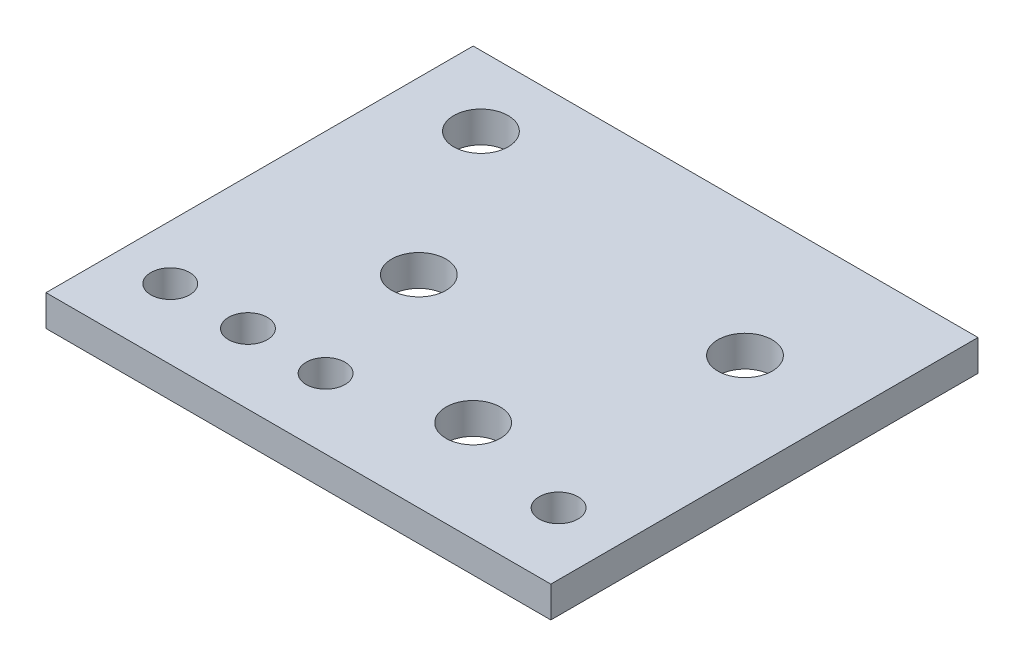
ISO-10303-21;
HEADER;
FILE_DESCRIPTION(('STEP AP214'),'2;1');
FILE_NAME('part.step','',(''),(''),'','','');
FILE_SCHEMA(('AUTOMOTIVE_DESIGN { 1 0 10303 214 1 1 1 1 }'));
ENDSEC;
DATA;
#1=APPLICATION_CONTEXT('core data for automotive mechanical design processes');
#2=APPLICATION_PROTOCOL_DEFINITION('international standard','automotive_design',2000,#1);
#3=PRODUCT_CONTEXT('',#1,'mechanical');
#4=PRODUCT('Part','Part','',(#3));
#5=PRODUCT_RELATED_PRODUCT_CATEGORY('part','',(#4));
#6=PRODUCT_DEFINITION_FORMATION('','',#4);
#7=PRODUCT_DEFINITION_CONTEXT('part definition',#1,'design');
#8=PRODUCT_DEFINITION('design','',#6,#7);
#9=PRODUCT_DEFINITION_SHAPE('','',#8);
#10=(LENGTH_UNIT() NAMED_UNIT(*) SI_UNIT(.MILLI.,.METRE.));
#11=(NAMED_UNIT(*) PLANE_ANGLE_UNIT() SI_UNIT($,.RADIAN.));
#12=(NAMED_UNIT(*) SI_UNIT($,.STERADIAN.) SOLID_ANGLE_UNIT());
#13=UNCERTAINTY_MEASURE_WITH_UNIT(LENGTH_MEASURE(1.E-05),#10,'distance_accuracy_value','');
#14=(GEOMETRIC_REPRESENTATION_CONTEXT(3) GLOBAL_UNCERTAINTY_ASSIGNED_CONTEXT((#13)) GLOBAL_UNIT_ASSIGNED_CONTEXT((#10,
#11,#12)) REPRESENTATION_CONTEXT('',''));
#15=CARTESIAN_POINT('',(0.,0.,0.));
#16=DIRECTION('',(0.,0.,1.));
#17=DIRECTION('',(1.,0.,0.));
#18=AXIS2_PLACEMENT_3D('',#15,#16,#17);
#19=CARTESIAN_POINT('',(0.,20.,0.));
#20=DIRECTION('',(1.,0.,0.));
#21=DIRECTION('',(0.,0.,-1.));
#22=AXIS2_PLACEMENT_3D('',#19,#20,#21);
#23=PLANE('',#22);
#24=DIRECTION('',(0.,0.,1.));
#25=VECTOR('',#24,1.);
#26=CARTESIAN_POINT('',(0.,0.,0.));
#27=LINE('',#26,#25);
#28=CARTESIAN_POINT('',(0.,0.,-275.));
#29=VERTEX_POINT('',#28);
#30=CARTESIAN_POINT('',(0.,0.,0.));
#31=VERTEX_POINT('',#30);
#32=EDGE_CURVE('E72',#29,#31,#27,.T.);
#33=ORIENTED_EDGE('',*,*,#32,.T.);
#34=DIRECTION('',(0.,-1.,0.));
#35=VECTOR('',#34,1.);
#36=CARTESIAN_POINT('',(0.,20.,0.));
#37=LINE('',#36,#35);
#38=CARTESIAN_POINT('',(0.,20.,0.));
#39=VERTEX_POINT('',#38);
#40=EDGE_CURVE('E11',#39,#31,#37,.T.);
#41=ORIENTED_EDGE('',*,*,#40,.F.);
#42=DIRECTION('',(0.,0.,1.));
#43=VECTOR('',#42,1.);
#44=CARTESIAN_POINT('',(0.,20.,0.));
#45=LINE('',#44,#43);
#46=CARTESIAN_POINT('',(0.,20.,-275.));
#47=VERTEX_POINT('',#46);
#48=EDGE_CURVE('E95',#47,#39,#45,.T.);
#49=ORIENTED_EDGE('',*,*,#48,.F.);
#50=DIRECTION('',(0.,-1.,0.));
#51=VECTOR('',#50,1.);
#52=CARTESIAN_POINT('',(0.,20.,-275.));
#53=LINE('',#52,#51);
#54=EDGE_CURVE('E84',#47,#29,#53,.T.);
#55=ORIENTED_EDGE('',*,*,#54,.T.);
#56=EDGE_LOOP('',(#33,#41,#49,#55));
#57=FACE_BOUND('',#56,.T.);
#58=ADVANCED_FACE('F28',(#57),#23,.F.);
#59=CARTESIAN_POINT('',(0.,20.,0.));
#60=DIRECTION('',(0.,0.,-1.));
#61=DIRECTION('',(-1.,0.,0.));
#62=AXIS2_PLACEMENT_3D('',#59,#60,#61);
#63=PLANE('',#62);
#64=DIRECTION('',(1.,0.,0.));
#65=VECTOR('',#64,1.);
#66=CARTESIAN_POINT('',(0.,0.,0.));
#67=LINE('',#66,#65);
#68=CARTESIAN_POINT('',(325.,0.,0.));
#69=VERTEX_POINT('',#68);
#70=EDGE_CURVE('E68',#31,#69,#67,.T.);
#71=ORIENTED_EDGE('',*,*,#70,.T.);
#72=DIRECTION('',(0.,-1.,0.));
#73=VECTOR('',#72,1.);
#74=CARTESIAN_POINT('',(325.,20.,0.));
#75=LINE('',#74,#73);
#76=CARTESIAN_POINT('',(325.,20.,0.));
#77=VERTEX_POINT('',#76);
#78=EDGE_CURVE('E35',#77,#69,#75,.T.);
#79=ORIENTED_EDGE('',*,*,#78,.F.);
#80=DIRECTION('',(1.,0.,0.));
#81=VECTOR('',#80,1.);
#82=CARTESIAN_POINT('',(0.,20.,0.));
#83=LINE('',#82,#81);
#84=EDGE_CURVE('E80',#39,#77,#83,.T.);
#85=ORIENTED_EDGE('',*,*,#84,.F.);
#86=ORIENTED_EDGE('',*,*,#40,.T.);
#87=EDGE_LOOP('',(#71,#79,#85,#86));
#88=FACE_BOUND('',#87,.T.);
#89=ADVANCED_FACE('F79',(#88),#63,.F.);
#90=CARTESIAN_POINT('',(325.,20.,0.));
#91=DIRECTION('',(-1.,0.,0.));
#92=DIRECTION('',(0.,0.,1.));
#93=AXIS2_PLACEMENT_3D('',#90,#91,#92);
#94=PLANE('',#93);
#95=DIRECTION('',(0.,0.,-1.));
#96=VECTOR('',#95,1.);
#97=CARTESIAN_POINT('',(325.,0.,0.));
#98=LINE('',#97,#96);
#99=CARTESIAN_POINT('',(325.,0.,-275.));
#100=VERTEX_POINT('',#99);
#101=EDGE_CURVE('E73',#69,#100,#98,.T.);
#102=ORIENTED_EDGE('',*,*,#101,.T.);
#103=DIRECTION('',(0.,-1.,0.));
#104=VECTOR('',#103,1.);
#105=CARTESIAN_POINT('',(325.,20.,-275.));
#106=LINE('',#105,#104);
#107=CARTESIAN_POINT('',(325.,20.,-275.));
#108=VERTEX_POINT('',#107);
#109=EDGE_CURVE('E101',#108,#100,#106,.T.);
#110=ORIENTED_EDGE('',*,*,#109,.F.);
#111=DIRECTION('',(0.,0.,-1.));
#112=VECTOR('',#111,1.);
#113=CARTESIAN_POINT('',(325.,20.,0.));
#114=LINE('',#113,#112);
#115=EDGE_CURVE('E47',#77,#108,#114,.T.);
#116=ORIENTED_EDGE('',*,*,#115,.F.);
#117=ORIENTED_EDGE('',*,*,#78,.T.);
#118=EDGE_LOOP('',(#102,#110,#116,#117));
#119=FACE_BOUND('',#118,.T.);
#120=ADVANCED_FACE('F104',(#119),#94,.F.);
#121=CARTESIAN_POINT('',(0.,20.,-275.));
#122=DIRECTION('',(0.,0.,1.));
#123=DIRECTION('',(1.,0.,0.));
#124=AXIS2_PLACEMENT_3D('',#121,#122,#123);
#125=PLANE('',#124);
#126=DIRECTION('',(-1.,0.,0.));
#127=VECTOR('',#126,1.);
#128=CARTESIAN_POINT('',(0.,0.,-275.));
#129=LINE('',#128,#127);
#130=EDGE_CURVE('E93',#100,#29,#129,.T.);
#131=ORIENTED_EDGE('',*,*,#130,.T.);
#132=ORIENTED_EDGE('',*,*,#54,.F.);
#133=DIRECTION('',(-1.,0.,0.));
#134=VECTOR('',#133,1.);
#135=CARTESIAN_POINT('',(0.,20.,-275.));
#136=LINE('',#135,#134);
#137=EDGE_CURVE('E42',#108,#47,#136,.T.);
#138=ORIENTED_EDGE('',*,*,#137,.F.);
#139=ORIENTED_EDGE('',*,*,#109,.T.);
#140=EDGE_LOOP('',(#131,#132,#138,#139));
#141=FACE_BOUND('',#140,.T.);
#142=ADVANCED_FACE('F106',(#141),#125,.F.);
#143=CARTESIAN_POINT('',(0.,20.,-275.));
#144=DIRECTION('',(0.,-1.,0.));
#145=DIRECTION('',(0.,0.,-1.));
#146=AXIS2_PLACEMENT_3D('',#143,#144,#145);
#147=PLANE('',#146);
#148=CARTESIAN_POINT('',(260.,19.9999999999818,-190.));
#149=DIRECTION('',(0.,1.,0.));
#150=DIRECTION('',(0.,0.,1.));
#151=AXIS2_PLACEMENT_3D('',#148,#149,#150);
#152=CIRCLE('',#151,17.5);
#153=CARTESIAN_POINT('',(260.,19.9999999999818,-172.5));
#154=VERTEX_POINT('',#153);
#155=EDGE_CURVE('E206',#154,#154,#152,.T.);
#156=ORIENTED_EDGE('',*,*,#155,.F.);
#157=EDGE_LOOP('',(#156));
#158=FACE_BOUND('',#157,.T.);
#159=CARTESIAN_POINT('',(110.,19.9999999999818,-130.));
#160=DIRECTION('',(0.,1.,0.));
#161=DIRECTION('',(0.,0.,1.));
#162=AXIS2_PLACEMENT_3D('',#159,#160,#161);
#163=CIRCLE('',#162,17.5);
#164=CARTESIAN_POINT('',(110.,19.9999999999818,-112.5));
#165=VERTEX_POINT('',#164);
#166=EDGE_CURVE('E208',#165,#165,#163,.T.);
#167=ORIENTED_EDGE('',*,*,#166,.F.);
#168=EDGE_LOOP('',(#167));
#169=FACE_BOUND('',#168,.T.);
#170=CARTESIAN_POINT('',(50.,19.9999999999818,-230.));
#171=DIRECTION('',(0.,1.,0.));
#172=DIRECTION('',(0.,0.,1.));
#173=AXIS2_PLACEMENT_3D('',#170,#171,#172);
#174=CIRCLE('',#173,17.5);
#175=CARTESIAN_POINT('',(50.,19.9999999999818,-212.5));
#176=VERTEX_POINT('',#175);
#177=EDGE_CURVE('E216',#176,#176,#174,.T.);
#178=ORIENTED_EDGE('',*,*,#177,.F.);
#179=EDGE_LOOP('',(#178));
#180=FACE_BOUND('',#179,.T.);
#181=CARTESIAN_POINT('',(285.,20.,-45.));
#182=DIRECTION('',(0.,1.,0.));
#183=DIRECTION('',(0.,0.,1.));
#184=AXIS2_PLACEMENT_3D('',#181,#182,#183);
#185=CIRCLE('',#184,12.5);
#186=CARTESIAN_POINT('',(285.,20.,-32.5));
#187=VERTEX_POINT('',#186);
#188=EDGE_CURVE('E222',#187,#187,#185,.T.);
#189=ORIENTED_EDGE('',*,*,#188,.F.);
#190=EDGE_LOOP('',(#189));
#191=FACE_BOUND('',#190,.T.);
#192=CARTESIAN_POINT('',(135.,20.,-45.));
#193=DIRECTION('',(0.,1.,0.));
#194=DIRECTION('',(0.,0.,1.));
#195=AXIS2_PLACEMENT_3D('',#192,#193,#194);
#196=CIRCLE('',#195,12.5);
#197=CARTESIAN_POINT('',(135.,20.,-32.5));
#198=VERTEX_POINT('',#197);
#199=EDGE_CURVE('E228',#198,#198,#196,.T.);
#200=ORIENTED_EDGE('',*,*,#199,.F.);
#201=EDGE_LOOP('',(#200));
#202=FACE_BOUND('',#201,.T.);
#203=CARTESIAN_POINT('',(85.,20.,-45.));
#204=DIRECTION('',(0.,1.,0.));
#205=DIRECTION('',(0.,0.,1.));
#206=AXIS2_PLACEMENT_3D('',#203,#204,#205);
#207=CIRCLE('',#206,12.5);
#208=CARTESIAN_POINT('',(85.,20.,-32.5));
#209=VERTEX_POINT('',#208);
#210=EDGE_CURVE('E234',#209,#209,#207,.T.);
#211=ORIENTED_EDGE('',*,*,#210,.F.);
#212=EDGE_LOOP('',(#211));
#213=FACE_BOUND('',#212,.T.);
#214=CARTESIAN_POINT('',(210.,19.9999999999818,-65.));
#215=DIRECTION('',(0.,1.,0.));
#216=DIRECTION('',(0.,0.,1.));
#217=AXIS2_PLACEMENT_3D('',#214,#215,#216);
#218=CIRCLE('',#217,17.5);
#219=CARTESIAN_POINT('',(210.,19.9999999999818,-47.5));
#220=VERTEX_POINT('',#219);
#221=EDGE_CURVE('E240',#220,#220,#218,.T.);
#222=ORIENTED_EDGE('',*,*,#221,.F.);
#223=EDGE_LOOP('',(#222));
#224=FACE_BOUND('',#223,.T.);
#225=CARTESIAN_POINT('',(35.,20.,-45.));
#226=DIRECTION('',(0.,1.,0.));
#227=DIRECTION('',(0.,0.,1.));
#228=AXIS2_PLACEMENT_3D('',#225,#226,#227);
#229=CIRCLE('',#228,12.5);
#230=CARTESIAN_POINT('',(35.,20.,-32.5));
#231=VERTEX_POINT('',#230);
#232=EDGE_CURVE('E88',#231,#231,#229,.T.);
#233=ORIENTED_EDGE('',*,*,#232,.F.);
#234=EDGE_LOOP('',(#233));
#235=FACE_BOUND('',#234,.T.);
#236=ORIENTED_EDGE('',*,*,#48,.T.);
#237=ORIENTED_EDGE('',*,*,#84,.T.);
#238=ORIENTED_EDGE('',*,*,#115,.T.);
#239=ORIENTED_EDGE('',*,*,#137,.T.);
#240=EDGE_LOOP('',(#236,#237,#238,#239));
#241=FACE_BOUND('',#240,.T.);
#242=ADVANCED_FACE('F107',(#158,#169,#180,#191,#202,#213,#224,#235,#241),#147,.F.);
#243=CARTESIAN_POINT('',(0.,0.,-275.));
#244=DIRECTION('',(0.,-1.,0.));
#245=DIRECTION('',(0.,0.,-1.));
#246=AXIS2_PLACEMENT_3D('',#243,#244,#245);
#247=PLANE('',#246);
#248=CARTESIAN_POINT('',(260.,0.,-190.));
#249=DIRECTION('',(0.,1.,0.));
#250=DIRECTION('',(0.,0.,1.));
#251=AXIS2_PLACEMENT_3D('',#248,#249,#250);
#252=CIRCLE('',#251,17.5);
#253=CARTESIAN_POINT('',(260.,0.,-172.5));
#254=VERTEX_POINT('',#253);
#255=EDGE_CURVE('E204',#254,#254,#252,.T.);
#256=ORIENTED_EDGE('',*,*,#255,.T.);
#257=EDGE_LOOP('',(#256));
#258=FACE_BOUND('',#257,.T.);
#259=CARTESIAN_POINT('',(110.,0.,-130.));
#260=DIRECTION('',(0.,1.,0.));
#261=DIRECTION('',(0.,0.,1.));
#262=AXIS2_PLACEMENT_3D('',#259,#260,#261);
#263=CIRCLE('',#262,17.5);
#264=CARTESIAN_POINT('',(110.,0.,-112.5));
#265=VERTEX_POINT('',#264);
#266=EDGE_CURVE('E213',#265,#265,#263,.T.);
#267=ORIENTED_EDGE('',*,*,#266,.T.);
#268=EDGE_LOOP('',(#267));
#269=FACE_BOUND('',#268,.T.);
#270=CARTESIAN_POINT('',(50.,0.,-230.));
#271=DIRECTION('',(0.,1.,0.));
#272=DIRECTION('',(0.,0.,1.));
#273=AXIS2_PLACEMENT_3D('',#270,#271,#272);
#274=CIRCLE('',#273,17.5);
#275=CARTESIAN_POINT('',(50.,0.,-212.5));
#276=VERTEX_POINT('',#275);
#277=EDGE_CURVE('E219',#276,#276,#274,.T.);
#278=ORIENTED_EDGE('',*,*,#277,.T.);
#279=EDGE_LOOP('',(#278));
#280=FACE_BOUND('',#279,.T.);
#281=CARTESIAN_POINT('',(285.,0.,-45.));
#282=DIRECTION('',(0.,1.,0.));
#283=DIRECTION('',(0.,0.,1.));
#284=AXIS2_PLACEMENT_3D('',#281,#282,#283);
#285=CIRCLE('',#284,12.5);
#286=CARTESIAN_POINT('',(285.,0.,-32.5));
#287=VERTEX_POINT('',#286);
#288=EDGE_CURVE('E225',#287,#287,#285,.T.);
#289=ORIENTED_EDGE('',*,*,#288,.T.);
#290=EDGE_LOOP('',(#289));
#291=FACE_BOUND('',#290,.T.);
#292=CARTESIAN_POINT('',(135.,0.,-45.));
#293=DIRECTION('',(0.,1.,0.));
#294=DIRECTION('',(0.,0.,1.));
#295=AXIS2_PLACEMENT_3D('',#292,#293,#294);
#296=CIRCLE('',#295,12.5);
#297=CARTESIAN_POINT('',(135.,0.,-32.5));
#298=VERTEX_POINT('',#297);
#299=EDGE_CURVE('E231',#298,#298,#296,.T.);
#300=ORIENTED_EDGE('',*,*,#299,.T.);
#301=EDGE_LOOP('',(#300));
#302=FACE_BOUND('',#301,.T.);
#303=CARTESIAN_POINT('',(85.,0.,-45.));
#304=DIRECTION('',(0.,1.,0.));
#305=DIRECTION('',(0.,0.,1.));
#306=AXIS2_PLACEMENT_3D('',#303,#304,#305);
#307=CIRCLE('',#306,12.5);
#308=CARTESIAN_POINT('',(85.,0.,-32.5));
#309=VERTEX_POINT('',#308);
#310=EDGE_CURVE('E237',#309,#309,#307,.T.);
#311=ORIENTED_EDGE('',*,*,#310,.T.);
#312=EDGE_LOOP('',(#311));
#313=FACE_BOUND('',#312,.T.);
#314=CARTESIAN_POINT('',(210.,0.,-65.));
#315=DIRECTION('',(0.,1.,0.));
#316=DIRECTION('',(0.,0.,1.));
#317=AXIS2_PLACEMENT_3D('',#314,#315,#316);
#318=CIRCLE('',#317,17.5);
#319=CARTESIAN_POINT('',(210.,0.,-47.5));
#320=VERTEX_POINT('',#319);
#321=EDGE_CURVE('E243',#320,#320,#318,.T.);
#322=ORIENTED_EDGE('',*,*,#321,.T.);
#323=EDGE_LOOP('',(#322));
#324=FACE_BOUND('',#323,.T.);
#325=CARTESIAN_POINT('',(35.,0.,-45.));
#326=DIRECTION('',(0.,1.,0.));
#327=DIRECTION('',(0.,0.,1.));
#328=AXIS2_PLACEMENT_3D('',#325,#326,#327);
#329=CIRCLE('',#328,12.5);
#330=CARTESIAN_POINT('',(35.,0.,-32.5));
#331=VERTEX_POINT('',#330);
#332=EDGE_CURVE('E85',#331,#331,#329,.T.);
#333=ORIENTED_EDGE('',*,*,#332,.T.);
#334=EDGE_LOOP('',(#333));
#335=FACE_BOUND('',#334,.T.);
#336=ORIENTED_EDGE('',*,*,#32,.F.);
#337=ORIENTED_EDGE('',*,*,#130,.F.);
#338=ORIENTED_EDGE('',*,*,#101,.F.);
#339=ORIENTED_EDGE('',*,*,#70,.F.);
#340=EDGE_LOOP('',(#336,#337,#338,#339));
#341=FACE_BOUND('',#340,.T.);
#342=ADVANCED_FACE('F69',(#258,#269,#280,#291,#302,#313,#324,#335,#341),#247,.T.);
#343=CARTESIAN_POINT('',(35.,0.,-45.));
#344=DIRECTION('',(0.,1.,0.));
#345=DIRECTION('',(0.,0.,1.));
#346=AXIS2_PLACEMENT_3D('',#343,#344,#345);
#347=CYLINDRICAL_SURFACE('',#346,12.5);
#348=ORIENTED_EDGE('',*,*,#332,.F.);
#349=EDGE_LOOP('',(#348));
#350=FACE_BOUND('',#349,.T.);
#351=ORIENTED_EDGE('',*,*,#232,.T.);
#352=EDGE_LOOP('',(#351));
#353=FACE_BOUND('',#352,.T.);
#354=ADVANCED_FACE('F115',(#350,#353),#347,.F.);
#355=CARTESIAN_POINT('',(210.,0.,-65.));
#356=DIRECTION('',(0.,1.,0.));
#357=DIRECTION('',(0.,0.,1.));
#358=AXIS2_PLACEMENT_3D('',#355,#356,#357);
#359=CYLINDRICAL_SURFACE('',#358,17.5);
#360=ORIENTED_EDGE('',*,*,#321,.F.);
#361=EDGE_LOOP('',(#360));
#362=FACE_BOUND('',#361,.T.);
#363=ORIENTED_EDGE('',*,*,#221,.T.);
#364=EDGE_LOOP('',(#363));
#365=FACE_BOUND('',#364,.T.);
#366=ADVANCED_FACE('F142',(#362,#365),#359,.F.);
#367=CARTESIAN_POINT('',(85.,0.,-45.));
#368=DIRECTION('',(0.,1.,0.));
#369=DIRECTION('',(0.,0.,1.));
#370=AXIS2_PLACEMENT_3D('',#367,#368,#369);
#371=CYLINDRICAL_SURFACE('',#370,12.5);
#372=ORIENTED_EDGE('',*,*,#310,.F.);
#373=EDGE_LOOP('',(#372));
#374=FACE_BOUND('',#373,.T.);
#375=ORIENTED_EDGE('',*,*,#210,.T.);
#376=EDGE_LOOP('',(#375));
#377=FACE_BOUND('',#376,.T.);
#378=ADVANCED_FACE('F151',(#374,#377),#371,.F.);
#379=CARTESIAN_POINT('',(135.,0.,-45.));
#380=DIRECTION('',(0.,1.,0.));
#381=DIRECTION('',(0.,0.,1.));
#382=AXIS2_PLACEMENT_3D('',#379,#380,#381);
#383=CYLINDRICAL_SURFACE('',#382,12.5);
#384=ORIENTED_EDGE('',*,*,#299,.F.);
#385=EDGE_LOOP('',(#384));
#386=FACE_BOUND('',#385,.T.);
#387=ORIENTED_EDGE('',*,*,#199,.T.);
#388=EDGE_LOOP('',(#387));
#389=FACE_BOUND('',#388,.T.);
#390=ADVANCED_FACE('F159',(#386,#389),#383,.F.);
#391=CARTESIAN_POINT('',(285.,0.,-45.));
#392=DIRECTION('',(0.,1.,0.));
#393=DIRECTION('',(0.,0.,1.));
#394=AXIS2_PLACEMENT_3D('',#391,#392,#393);
#395=CYLINDRICAL_SURFACE('',#394,12.5);
#396=ORIENTED_EDGE('',*,*,#288,.F.);
#397=EDGE_LOOP('',(#396));
#398=FACE_BOUND('',#397,.T.);
#399=ORIENTED_EDGE('',*,*,#188,.T.);
#400=EDGE_LOOP('',(#399));
#401=FACE_BOUND('',#400,.T.);
#402=ADVANCED_FACE('F166',(#398,#401),#395,.F.);
#403=CARTESIAN_POINT('',(50.,0.,-230.));
#404=DIRECTION('',(0.,1.,0.));
#405=DIRECTION('',(0.,0.,1.));
#406=AXIS2_PLACEMENT_3D('',#403,#404,#405);
#407=CYLINDRICAL_SURFACE('',#406,17.5);
#408=ORIENTED_EDGE('',*,*,#277,.F.);
#409=EDGE_LOOP('',(#408));
#410=FACE_BOUND('',#409,.T.);
#411=ORIENTED_EDGE('',*,*,#177,.T.);
#412=EDGE_LOOP('',(#411));
#413=FACE_BOUND('',#412,.T.);
#414=ADVANCED_FACE('F173',(#410,#413),#407,.F.);
#415=CARTESIAN_POINT('',(110.,0.,-130.));
#416=DIRECTION('',(0.,1.,0.));
#417=DIRECTION('',(0.,0.,1.));
#418=AXIS2_PLACEMENT_3D('',#415,#416,#417);
#419=CYLINDRICAL_SURFACE('',#418,17.5);
#420=ORIENTED_EDGE('',*,*,#266,.F.);
#421=EDGE_LOOP('',(#420));
#422=FACE_BOUND('',#421,.T.);
#423=ORIENTED_EDGE('',*,*,#166,.T.);
#424=EDGE_LOOP('',(#423));
#425=FACE_BOUND('',#424,.T.);
#426=ADVANCED_FACE('F183',(#422,#425),#419,.F.);
#427=CARTESIAN_POINT('',(260.,0.,-190.));
#428=DIRECTION('',(0.,1.,0.));
#429=DIRECTION('',(0.,0.,1.));
#430=AXIS2_PLACEMENT_3D('',#427,#428,#429);
#431=CYLINDRICAL_SURFACE('',#430,17.5);
#432=ORIENTED_EDGE('',*,*,#255,.F.);
#433=EDGE_LOOP('',(#432));
#434=FACE_BOUND('',#433,.T.);
#435=ORIENTED_EDGE('',*,*,#155,.T.);
#436=EDGE_LOOP('',(#435));
#437=FACE_BOUND('',#436,.T.);
#438=ADVANCED_FACE('F191',(#434,#437),#431,.F.);
#439=CLOSED_SHELL('',(#58,#89,#120,#142,#242,#342,#354,#366,#378,#390,#402,#414,#426,#438));
#440=MANIFOLD_SOLID_BREP('B2',#439);
#441=ADVANCED_BREP_SHAPE_REPRESENTATION('',(#18,#440),#14);
#442=SHAPE_DEFINITION_REPRESENTATION(#9,#441);
ENDSEC;
END-ISO-10303-21;
